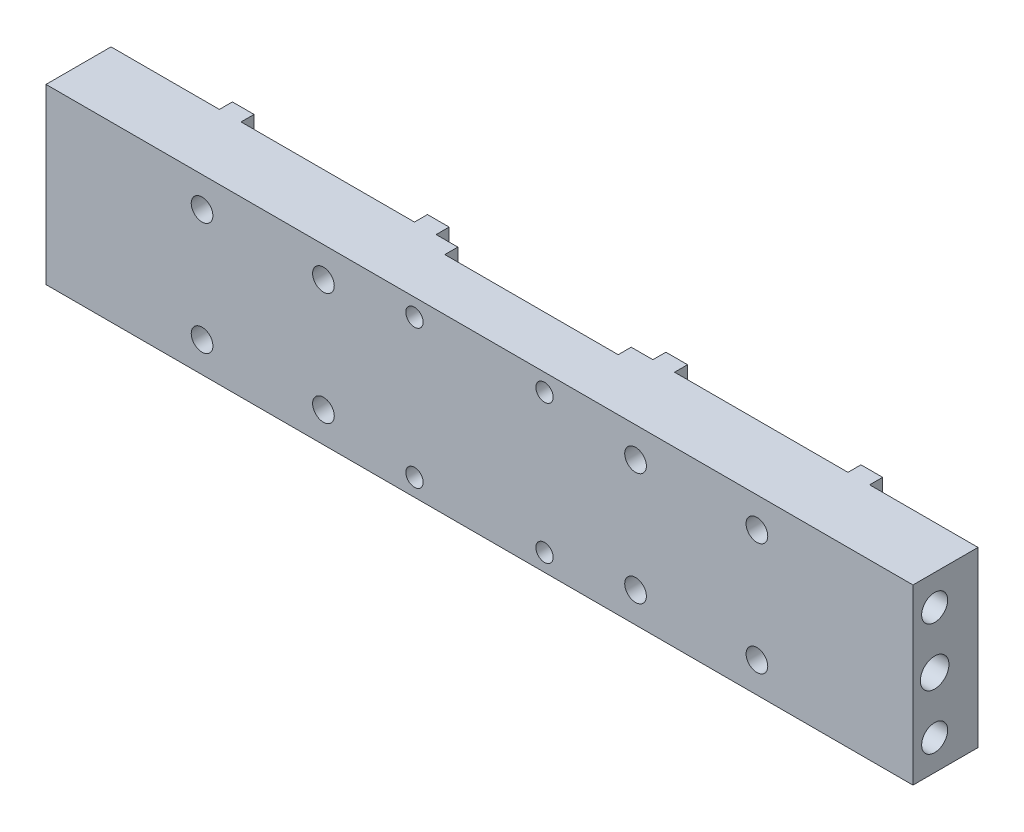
ISO-10303-21;
HEADER;
FILE_DESCRIPTION(('STEP AP214'),'2;1');
FILE_NAME('part.step','',(''),(''),'','','');
FILE_SCHEMA(('AUTOMOTIVE_DESIGN { 1 0 10303 214 1 1 1 1 }'));
ENDSEC;
DATA;
#1=APPLICATION_CONTEXT('core data for automotive mechanical design processes');
#2=APPLICATION_PROTOCOL_DEFINITION('international standard','automotive_design',2000,#1);
#3=PRODUCT_CONTEXT('',#1,'mechanical');
#4=PRODUCT('Part','Part','',(#3));
#5=PRODUCT_RELATED_PRODUCT_CATEGORY('part','',(#4));
#6=PRODUCT_DEFINITION_FORMATION('','',#4);
#7=PRODUCT_DEFINITION_CONTEXT('part definition',#1,'design');
#8=PRODUCT_DEFINITION('design','',#6,#7);
#9=PRODUCT_DEFINITION_SHAPE('','',#8);
#10=(LENGTH_UNIT() NAMED_UNIT(*) SI_UNIT(.MILLI.,.METRE.));
#11=(NAMED_UNIT(*) PLANE_ANGLE_UNIT() SI_UNIT($,.RADIAN.));
#12=(NAMED_UNIT(*) SI_UNIT($,.STERADIAN.) SOLID_ANGLE_UNIT());
#13=UNCERTAINTY_MEASURE_WITH_UNIT(LENGTH_MEASURE(1.E-05),#10,'distance_accuracy_value','');
#14=(GEOMETRIC_REPRESENTATION_CONTEXT(3) GLOBAL_UNCERTAINTY_ASSIGNED_CONTEXT((#13)) GLOBAL_UNIT_ASSIGNED_CONTEXT((#10,
#11,#12)) REPRESENTATION_CONTEXT('',''));
#15=CARTESIAN_POINT('',(0.,0.,0.));
#16=DIRECTION('',(0.,0.,1.));
#17=DIRECTION('',(1.,0.,0.));
#18=AXIS2_PLACEMENT_3D('',#15,#16,#17);
#19=CARTESIAN_POINT('',(0.,0.,-3.));
#20=DIRECTION('',(0.,0.,1.));
#21=DIRECTION('',(1.,0.,0.));
#22=AXIS2_PLACEMENT_3D('',#19,#20,#21);
#23=PLANE('',#22);
#24=CARTESIAN_POINT('',(-64.,-46.607626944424,-3.));
#25=DIRECTION('',(0.,0.,-1.));
#26=DIRECTION('',(-1.,0.,0.));
#27=AXIS2_PLACEMENT_3D('',#24,#25,#26);
#28=CIRCLE('',#27,2.5);
#29=CARTESIAN_POINT('',(-66.5,-46.607626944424,-3.));
#30=VERTEX_POINT('',#29);
#31=EDGE_CURVE('E359',#30,#30,#28,.T.);
#32=ORIENTED_EDGE('',*,*,#31,.F.);
#33=EDGE_LOOP('',(#32));
#34=FACE_BOUND('',#33,.T.);
#35=CARTESIAN_POINT('',(-64.,-20.607626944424,-3.));
#36=DIRECTION('',(0.,0.,-1.));
#37=DIRECTION('',(-1.,0.,0.));
#38=AXIS2_PLACEMENT_3D('',#35,#36,#37);
#39=CIRCLE('',#38,2.49999999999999);
#40=CARTESIAN_POINT('',(-66.5,-20.607626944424,-3.));
#41=VERTEX_POINT('',#40);
#42=EDGE_CURVE('E365',#41,#41,#39,.T.);
#43=ORIENTED_EDGE('',*,*,#42,.F.);
#44=EDGE_LOOP('',(#43));
#45=FACE_BOUND('',#44,.T.);
#46=CARTESIAN_POINT('',(-36.,-20.607626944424,-3.));
#47=DIRECTION('',(0.,0.,-1.));
#48=DIRECTION('',(-1.,0.,0.));
#49=AXIS2_PLACEMENT_3D('',#46,#47,#48);
#50=CIRCLE('',#49,2.50000000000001);
#51=CARTESIAN_POINT('',(-38.5,-20.607626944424,-3.));
#52=VERTEX_POINT('',#51);
#53=EDGE_CURVE('E362',#52,#52,#50,.T.);
#54=ORIENTED_EDGE('',*,*,#53,.F.);
#55=EDGE_LOOP('',(#54));
#56=FACE_BOUND('',#55,.T.);
#57=CARTESIAN_POINT('',(-36.,-46.607626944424,-3.));
#58=DIRECTION('',(0.,0.,-1.));
#59=DIRECTION('',(-1.,0.,0.));
#60=AXIS2_PLACEMENT_3D('',#57,#58,#59);
#61=CIRCLE('',#60,2.5);
#62=CARTESIAN_POINT('',(-38.5,-46.607626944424,-3.));
#63=VERTEX_POINT('',#62);
#64=EDGE_CURVE('E354',#63,#63,#61,.T.);
#65=ORIENTED_EDGE('',*,*,#64,.F.);
#66=EDGE_LOOP('',(#65));
#67=FACE_BOUND('',#66,.T.);
#68=DIRECTION('',(0.,-1.,0.));
#69=VECTOR('',#68,1.);
#70=CARTESIAN_POINT('',(-70.,-13.607626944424,-3.));
#71=LINE('',#70,#69);
#72=CARTESIAN_POINT('',(-70.,-13.607626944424,-3.));
#73=VERTEX_POINT('',#72);
#74=CARTESIAN_POINT('',(-70.,-53.607626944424,-3.));
#75=VERTEX_POINT('',#74);
#76=EDGE_CURVE('E227',#73,#75,#71,.T.);
#77=ORIENTED_EDGE('',*,*,#76,.F.);
#78=DIRECTION('',(1.,0.,0.));
#79=VECTOR('',#78,1.);
#80=CARTESIAN_POINT('',(-100.,-13.607626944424,-3.));
#81=LINE('',#80,#79);
#82=CARTESIAN_POINT('',(-30.,-13.607626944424,-3.));
#83=VERTEX_POINT('',#82);
#84=EDGE_CURVE('E376',#73,#83,#81,.T.);
#85=ORIENTED_EDGE('',*,*,#84,.T.);
#86=DIRECTION('',(0.,1.,0.));
#87=VECTOR('',#86,1.);
#88=CARTESIAN_POINT('',(-30.,-13.607626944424,-3.));
#89=LINE('',#88,#87);
#90=CARTESIAN_POINT('',(-30.,-53.607626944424,-3.));
#91=VERTEX_POINT('',#90);
#92=EDGE_CURVE('E278',#91,#83,#89,.T.);
#93=ORIENTED_EDGE('',*,*,#92,.F.);
#94=DIRECTION('',(-1.,0.,0.));
#95=VECTOR('',#94,1.);
#96=CARTESIAN_POINT('',(-100.,-53.607626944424,-3.));
#97=LINE('',#96,#95);
#98=EDGE_CURVE('E63',#91,#75,#97,.T.);
#99=ORIENTED_EDGE('',*,*,#98,.T.);
#100=EDGE_LOOP('',(#77,#85,#93,#99));
#101=FACE_BOUND('',#100,.T.);
#102=ADVANCED_FACE('F37',(#34,#45,#56,#67,#101),#23,.F.);
#103=DIRECTION('',(0.,1.,0.));
#104=VECTOR('',#103,1.);
#105=CARTESIAN_POINT('',(-75.,-13.607626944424,-3.));
#106=LINE('',#105,#104);
#107=CARTESIAN_POINT('',(-75.,-53.607626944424,-3.));
#108=VERTEX_POINT('',#107);
#109=CARTESIAN_POINT('',(-75.,-13.607626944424,-3.));
#110=VERTEX_POINT('',#109);
#111=EDGE_CURVE('E55',#108,#110,#106,.T.);
#112=ORIENTED_EDGE('',*,*,#111,.F.);
#113=CARTESIAN_POINT('',(-100.,-53.607626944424,-3.));
#114=VERTEX_POINT('',#113);
#115=EDGE_CURVE('E378',#108,#114,#97,.T.);
#116=ORIENTED_EDGE('',*,*,#115,.T.);
#117=DIRECTION('',(0.,1.,0.));
#118=VECTOR('',#117,1.);
#119=CARTESIAN_POINT('',(-100.,-13.607626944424,-3.));
#120=LINE('',#119,#118);
#121=CARTESIAN_POINT('',(-100.,-13.607626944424,-3.));
#122=VERTEX_POINT('',#121);
#123=EDGE_CURVE('E369',#114,#122,#120,.T.);
#124=ORIENTED_EDGE('',*,*,#123,.T.);
#125=EDGE_CURVE('E373',#122,#110,#81,.T.);
#126=ORIENTED_EDGE('',*,*,#125,.T.);
#127=EDGE_LOOP('',(#112,#116,#124,#126));
#128=FACE_BOUND('',#127,.T.);
#129=ADVANCED_FACE('F526',(#128),#23,.F.);
#130=CARTESIAN_POINT('',(0.,0.,-3.));
#131=DIRECTION('',(0.,0.,-1.));
#132=DIRECTION('',(-1.,0.,0.));
#133=AXIS2_PLACEMENT_3D('',#130,#131,#132);
#134=PLANE('',#133);
#135=CARTESIAN_POINT('',(36.,-46.607626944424,-3.));
#136=DIRECTION('',(0.,0.,-1.));
#137=DIRECTION('',(-1.,0.,0.));
#138=AXIS2_PLACEMENT_3D('',#135,#136,#137);
#139=CIRCLE('',#138,2.49999999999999);
#140=CARTESIAN_POINT('',(33.5,-46.607626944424,-3.));
#141=VERTEX_POINT('',#140);
#142=EDGE_CURVE('E390',#141,#141,#139,.T.);
#143=ORIENTED_EDGE('',*,*,#142,.F.);
#144=EDGE_LOOP('',(#143));
#145=FACE_BOUND('',#144,.T.);
#146=CARTESIAN_POINT('',(36.,-20.607626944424,-3.));
#147=DIRECTION('',(0.,0.,-1.));
#148=DIRECTION('',(-1.,0.,0.));
#149=AXIS2_PLACEMENT_3D('',#146,#147,#148);
#150=CIRCLE('',#149,2.49999999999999);
#151=CARTESIAN_POINT('',(33.5,-20.607626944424,-3.));
#152=VERTEX_POINT('',#151);
#153=EDGE_CURVE('E396',#152,#152,#150,.T.);
#154=ORIENTED_EDGE('',*,*,#153,.F.);
#155=EDGE_LOOP('',(#154));
#156=FACE_BOUND('',#155,.T.);
#157=CARTESIAN_POINT('',(64.,-20.607626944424,-3.));
#158=DIRECTION('',(0.,0.,-1.));
#159=DIRECTION('',(-1.,0.,0.));
#160=AXIS2_PLACEMENT_3D('',#157,#158,#159);
#161=CIRCLE('',#160,2.49999999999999);
#162=CARTESIAN_POINT('',(61.5,-20.607626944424,-3.));
#163=VERTEX_POINT('',#162);
#164=EDGE_CURVE('E393',#163,#163,#161,.T.);
#165=ORIENTED_EDGE('',*,*,#164,.F.);
#166=EDGE_LOOP('',(#165));
#167=FACE_BOUND('',#166,.T.);
#168=CARTESIAN_POINT('',(64.,-46.607626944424,-3.));
#169=DIRECTION('',(0.,0.,-1.));
#170=DIRECTION('',(-1.,0.,0.));
#171=AXIS2_PLACEMENT_3D('',#168,#169,#170);
#172=CIRCLE('',#171,2.50000000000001);
#173=CARTESIAN_POINT('',(61.5,-46.607626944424,-3.));
#174=VERTEX_POINT('',#173);
#175=EDGE_CURVE('E387',#174,#174,#172,.T.);
#176=ORIENTED_EDGE('',*,*,#175,.F.);
#177=EDGE_LOOP('',(#176));
#178=FACE_BOUND('',#177,.T.);
#179=DIRECTION('',(1.,0.,0.));
#180=VECTOR('',#179,1.);
#181=CARTESIAN_POINT('',(100.,-13.607626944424,-3.));
#182=LINE('',#181,#180);
#183=CARTESIAN_POINT('',(30.,-13.607626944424,-3.));
#184=VERTEX_POINT('',#183);
#185=CARTESIAN_POINT('',(70.,-13.607626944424,-3.));
#186=VERTEX_POINT('',#185);
#187=EDGE_CURVE('E413',#184,#186,#182,.T.);
#188=ORIENTED_EDGE('',*,*,#187,.T.);
#189=DIRECTION('',(0.,1.,0.));
#190=VECTOR('',#189,1.);
#191=CARTESIAN_POINT('',(70.,-13.607626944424,-3.));
#192=LINE('',#191,#190);
#193=CARTESIAN_POINT('',(70.,-53.607626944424,-3.));
#194=VERTEX_POINT('',#193);
#195=EDGE_CURVE('E251',#194,#186,#192,.T.);
#196=ORIENTED_EDGE('',*,*,#195,.F.);
#197=DIRECTION('',(-1.,0.,0.));
#198=VECTOR('',#197,1.);
#199=CARTESIAN_POINT('',(100.,-53.607626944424,-3.));
#200=LINE('',#199,#198);
#201=CARTESIAN_POINT('',(30.,-53.607626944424,-3.));
#202=VERTEX_POINT('',#201);
#203=EDGE_CURVE('E407',#194,#202,#200,.T.);
#204=ORIENTED_EDGE('',*,*,#203,.T.);
#205=DIRECTION('',(0.,-1.,0.));
#206=VECTOR('',#205,1.);
#207=CARTESIAN_POINT('',(30.,-13.607626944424,-3.));
#208=LINE('',#207,#206);
#209=EDGE_CURVE('E305',#184,#202,#208,.T.);
#210=ORIENTED_EDGE('',*,*,#209,.F.);
#211=EDGE_LOOP('',(#188,#196,#204,#210));
#212=FACE_BOUND('',#211,.T.);
#213=ADVANCED_FACE('F582',(#145,#156,#167,#178,#212),#134,.T.);
#214=CARTESIAN_POINT('',(100.,-53.607626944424,-3.));
#215=VERTEX_POINT('',#214);
#216=CARTESIAN_POINT('',(75.,-53.607626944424,-3.));
#217=VERTEX_POINT('',#216);
#218=EDGE_CURVE('E404',#215,#217,#200,.T.);
#219=ORIENTED_EDGE('',*,*,#218,.T.);
#220=DIRECTION('',(0.,-1.,0.));
#221=VECTOR('',#220,1.);
#222=CARTESIAN_POINT('',(75.,-13.607626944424,-3.));
#223=LINE('',#222,#221);
#224=CARTESIAN_POINT('',(75.,-13.607626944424,-3.));
#225=VERTEX_POINT('',#224);
#226=EDGE_CURVE('E256',#225,#217,#223,.T.);
#227=ORIENTED_EDGE('',*,*,#226,.F.);
#228=CARTESIAN_POINT('',(100.,-13.607626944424,-3.));
#229=VERTEX_POINT('',#228);
#230=EDGE_CURVE('E409',#225,#229,#182,.T.);
#231=ORIENTED_EDGE('',*,*,#230,.T.);
#232=DIRECTION('',(0.,-1.,0.));
#233=VECTOR('',#232,1.);
#234=CARTESIAN_POINT('',(100.,-13.607626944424,-3.));
#235=LINE('',#234,#233);
#236=EDGE_CURVE('E400',#229,#215,#235,.T.);
#237=ORIENTED_EDGE('',*,*,#236,.T.);
#238=EDGE_LOOP('',(#219,#227,#231,#237));
#239=FACE_BOUND('',#238,.T.);
#240=ADVANCED_FACE('F511',(#239),#134,.T.);
#241=DIRECTION('',(0.,-1.,0.));
#242=VECTOR('',#241,1.);
#243=CARTESIAN_POINT('',(-25.,-13.607626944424,-3.));
#244=LINE('',#243,#242);
#245=CARTESIAN_POINT('',(-25.,-13.607626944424,-3.));
#246=VERTEX_POINT('',#245);
#247=CARTESIAN_POINT('',(-25.,-53.607626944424,-3.));
#248=VERTEX_POINT('',#247);
#249=EDGE_CURVE('E283',#246,#248,#244,.T.);
#250=ORIENTED_EDGE('',*,*,#249,.F.);
#251=CARTESIAN_POINT('',(-20.,-13.607626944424,-3.));
#252=VERTEX_POINT('',#251);
#253=EDGE_CURVE('E372',#246,#252,#81,.T.);
#254=ORIENTED_EDGE('',*,*,#253,.T.);
#255=DIRECTION('',(0.,-1.,0.));
#256=VECTOR('',#255,1.);
#257=CARTESIAN_POINT('',(-20.,-13.607626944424,-3.));
#258=LINE('',#257,#256);
#259=CARTESIAN_POINT('',(-20.,-53.607626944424,-3.));
#260=VERTEX_POINT('',#259);
#261=EDGE_CURVE('E375',#252,#260,#258,.T.);
#262=ORIENTED_EDGE('',*,*,#261,.T.);
#263=EDGE_CURVE('E379',#260,#248,#97,.T.);
#264=ORIENTED_EDGE('',*,*,#263,.T.);
#265=EDGE_LOOP('',(#250,#254,#262,#264));
#266=FACE_BOUND('',#265,.T.);
#267=ADVANCED_FACE('F555',(#266),#23,.F.);
#268=CARTESIAN_POINT('',(20.,-13.607626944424,-3.));
#269=VERTEX_POINT('',#268);
#270=CARTESIAN_POINT('',(25.,-13.607626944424,-3.));
#271=VERTEX_POINT('',#270);
#272=EDGE_CURVE('E410',#269,#271,#182,.T.);
#273=ORIENTED_EDGE('',*,*,#272,.T.);
#274=DIRECTION('',(0.,1.,0.));
#275=VECTOR('',#274,1.);
#276=CARTESIAN_POINT('',(25.,-13.607626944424,-3.));
#277=LINE('',#276,#275);
#278=CARTESIAN_POINT('',(25.,-53.607626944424,-3.));
#279=VERTEX_POINT('',#278);
#280=EDGE_CURVE('E310',#279,#271,#277,.T.);
#281=ORIENTED_EDGE('',*,*,#280,.F.);
#282=CARTESIAN_POINT('',(20.,-53.607626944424,-3.));
#283=VERTEX_POINT('',#282);
#284=EDGE_CURVE('E403',#279,#283,#200,.T.);
#285=ORIENTED_EDGE('',*,*,#284,.T.);
#286=DIRECTION('',(0.,1.,0.));
#287=VECTOR('',#286,1.);
#288=CARTESIAN_POINT('',(20.,-13.607626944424,-3.));
#289=LINE('',#288,#287);
#290=EDGE_CURVE('E406',#283,#269,#289,.T.);
#291=ORIENTED_EDGE('',*,*,#290,.T.);
#292=EDGE_LOOP('',(#273,#281,#285,#291));
#293=FACE_BOUND('',#292,.T.);
#294=ADVANCED_FACE('F573',(#293),#134,.T.);
#295=CARTESIAN_POINT('',(-100.,-53.607626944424,0.));
#296=DIRECTION('',(0.,0.,1.));
#297=DIRECTION('',(1.,0.,0.));
#298=AXIS2_PLACEMENT_3D('',#295,#296,#297);
#299=PLANE('',#298);
#300=CARTESIAN_POINT('',(-15.,-17.607626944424,0.));
#301=DIRECTION('',(0.,0.,1.));
#302=DIRECTION('',(1.,0.,0.));
#303=AXIS2_PLACEMENT_3D('',#300,#301,#302);
#304=CIRCLE('',#303,2.);
#305=CARTESIAN_POINT('',(-13.,-17.607626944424,0.));
#306=VERTEX_POINT('',#305);
#307=EDGE_CURVE('E439',#306,#306,#304,.T.);
#308=ORIENTED_EDGE('',*,*,#307,.T.);
#309=EDGE_LOOP('',(#308));
#310=FACE_BOUND('',#309,.T.);
#311=CARTESIAN_POINT('',(15.,-17.607626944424,0.));
#312=DIRECTION('',(0.,0.,1.));
#313=DIRECTION('',(1.,0.,0.));
#314=AXIS2_PLACEMENT_3D('',#311,#312,#313);
#315=CIRCLE('',#314,2.);
#316=CARTESIAN_POINT('',(17.,-17.607626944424,0.));
#317=VERTEX_POINT('',#316);
#318=EDGE_CURVE('E450',#317,#317,#315,.T.);
#319=ORIENTED_EDGE('',*,*,#318,.T.);
#320=EDGE_LOOP('',(#319));
#321=FACE_BOUND('',#320,.T.);
#322=CARTESIAN_POINT('',(15.,-49.607626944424,0.));
#323=DIRECTION('',(0.,0.,1.));
#324=DIRECTION('',(1.,0.,0.));
#325=AXIS2_PLACEMENT_3D('',#322,#323,#324);
#326=CIRCLE('',#325,2.);
#327=CARTESIAN_POINT('',(17.,-49.607626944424,0.));
#328=VERTEX_POINT('',#327);
#329=EDGE_CURVE('E444',#328,#328,#326,.T.);
#330=ORIENTED_EDGE('',*,*,#329,.T.);
#331=EDGE_LOOP('',(#330));
#332=FACE_BOUND('',#331,.T.);
#333=CARTESIAN_POINT('',(-15.,-49.607626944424,0.));
#334=DIRECTION('',(0.,0.,1.));
#335=DIRECTION('',(1.,0.,0.));
#336=AXIS2_PLACEMENT_3D('',#333,#334,#335);
#337=CIRCLE('',#336,2.);
#338=CARTESIAN_POINT('',(-13.,-49.607626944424,0.));
#339=VERTEX_POINT('',#338);
#340=EDGE_CURVE('E430',#339,#339,#337,.T.);
#341=ORIENTED_EDGE('',*,*,#340,.T.);
#342=EDGE_LOOP('',(#341));
#343=FACE_BOUND('',#342,.T.);
#344=DIRECTION('',(0.,-1.,0.));
#345=VECTOR('',#344,1.);
#346=CARTESIAN_POINT('',(-20.,-13.607626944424,0.));
#347=LINE('',#346,#345);
#348=CARTESIAN_POINT('',(-20.,-13.607626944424,0.));
#349=VERTEX_POINT('',#348);
#350=CARTESIAN_POINT('',(-20.,-53.607626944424,0.));
#351=VERTEX_POINT('',#350);
#352=EDGE_CURVE('E368',#349,#351,#347,.T.);
#353=ORIENTED_EDGE('',*,*,#352,.F.);
#354=DIRECTION('',(-1.,0.,0.));
#355=VECTOR('',#354,1.);
#356=CARTESIAN_POINT('',(-100.,-13.607626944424,0.));
#357=LINE('',#356,#355);
#358=CARTESIAN_POINT('',(20.,-13.607626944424,0.));
#359=VERTEX_POINT('',#358);
#360=EDGE_CURVE('E422',#359,#349,#357,.T.);
#361=ORIENTED_EDGE('',*,*,#360,.F.);
#362=DIRECTION('',(0.,1.,0.));
#363=VECTOR('',#362,1.);
#364=CARTESIAN_POINT('',(20.,-13.607626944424,0.));
#365=LINE('',#364,#363);
#366=CARTESIAN_POINT('',(20.,-53.607626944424,0.));
#367=VERTEX_POINT('',#366);
#368=EDGE_CURVE('E399',#367,#359,#365,.T.);
#369=ORIENTED_EDGE('',*,*,#368,.F.);
#370=DIRECTION('',(1.,0.,0.));
#371=VECTOR('',#370,1.);
#372=CARTESIAN_POINT('',(-100.,-53.607626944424,0.));
#373=LINE('',#372,#371);
#374=EDGE_CURVE('E41',#351,#367,#373,.T.);
#375=ORIENTED_EDGE('',*,*,#374,.F.);
#376=EDGE_LOOP('',(#353,#361,#369,#375));
#377=FACE_BOUND('',#376,.T.);
#378=ADVANCED_FACE('F566',(#310,#321,#332,#343,#377),#299,.F.);
#379=CARTESIAN_POINT('',(-100.,-53.607626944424,12.));
#380=DIRECTION('',(0.,0.,1.));
#381=DIRECTION('',(1.,0.,0.));
#382=AXIS2_PLACEMENT_3D('',#379,#380,#381);
#383=PLANE('',#382);
#384=CARTESIAN_POINT('',(-15.,-17.607626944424,12.));
#385=DIRECTION('',(0.,0.,1.));
#386=DIRECTION('',(1.,0.,0.));
#387=AXIS2_PLACEMENT_3D('',#384,#385,#386);
#388=CIRCLE('',#387,2.);
#389=CARTESIAN_POINT('',(-13.,-17.607626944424,12.));
#390=VERTEX_POINT('',#389);
#391=EDGE_CURVE('E441',#390,#390,#388,.T.);
#392=ORIENTED_EDGE('',*,*,#391,.F.);
#393=EDGE_LOOP('',(#392));
#394=FACE_BOUND('',#393,.T.);
#395=CARTESIAN_POINT('',(15.,-17.607626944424,12.));
#396=DIRECTION('',(0.,0.,1.));
#397=DIRECTION('',(1.,0.,0.));
#398=AXIS2_PLACEMENT_3D('',#395,#396,#397);
#399=CIRCLE('',#398,2.);
#400=CARTESIAN_POINT('',(17.,-17.607626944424,12.));
#401=VERTEX_POINT('',#400);
#402=EDGE_CURVE('E453',#401,#401,#399,.T.);
#403=ORIENTED_EDGE('',*,*,#402,.F.);
#404=EDGE_LOOP('',(#403));
#405=FACE_BOUND('',#404,.T.);
#406=CARTESIAN_POINT('',(36.,-46.607626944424,12.));
#407=DIRECTION('',(0.,0.,1.));
#408=DIRECTION('',(1.,0.,0.));
#409=AXIS2_PLACEMENT_3D('',#406,#407,#408);
#410=CIRCLE('',#409,2.5);
#411=CARTESIAN_POINT('',(38.5,-46.607626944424,12.));
#412=VERTEX_POINT('',#411);
#413=EDGE_CURVE('E461',#412,#412,#410,.T.);
#414=ORIENTED_EDGE('',*,*,#413,.F.);
#415=EDGE_LOOP('',(#414));
#416=FACE_BOUND('',#415,.T.);
#417=CARTESIAN_POINT('',(36.,-20.607626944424,12.));
#418=DIRECTION('',(0.,0.,1.));
#419=DIRECTION('',(1.,0.,0.));
#420=AXIS2_PLACEMENT_3D('',#417,#418,#419);
#421=CIRCLE('',#420,2.49999999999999);
#422=CARTESIAN_POINT('',(38.5,-20.607626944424,12.));
#423=VERTEX_POINT('',#422);
#424=EDGE_CURVE('E467',#423,#423,#421,.T.);
#425=ORIENTED_EDGE('',*,*,#424,.F.);
#426=EDGE_LOOP('',(#425));
#427=FACE_BOUND('',#426,.T.);
#428=CARTESIAN_POINT('',(-64.,-46.607626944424,12.));
#429=DIRECTION('',(0.,0.,1.));
#430=DIRECTION('',(1.,0.,0.));
#431=AXIS2_PLACEMENT_3D('',#428,#429,#430);
#432=CIRCLE('',#431,2.5);
#433=CARTESIAN_POINT('',(-61.5,-46.607626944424,12.));
#434=VERTEX_POINT('',#433);
#435=EDGE_CURVE('E473',#434,#434,#432,.T.);
#436=ORIENTED_EDGE('',*,*,#435,.F.);
#437=EDGE_LOOP('',(#436));
#438=FACE_BOUND('',#437,.T.);
#439=CARTESIAN_POINT('',(-64.,-20.607626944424,12.));
#440=DIRECTION('',(0.,0.,1.));
#441=DIRECTION('',(1.,0.,0.));
#442=AXIS2_PLACEMENT_3D('',#439,#440,#441);
#443=CIRCLE('',#442,2.49999999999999);
#444=CARTESIAN_POINT('',(-61.5,-20.607626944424,12.));
#445=VERTEX_POINT('',#444);
#446=EDGE_CURVE('E479',#445,#445,#443,.T.);
#447=ORIENTED_EDGE('',*,*,#446,.F.);
#448=EDGE_LOOP('',(#447));
#449=FACE_BOUND('',#448,.T.);
#450=DIRECTION('',(0.,-1.,0.));
#451=VECTOR('',#450,1.);
#452=CARTESIAN_POINT('',(-100.,-13.607626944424,12.));
#453=LINE('',#452,#451);
#454=CARTESIAN_POINT('',(-100.,-13.607626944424,12.));
#455=VERTEX_POINT('',#454);
#456=CARTESIAN_POINT('',(-100.,-53.607626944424,12.));
#457=VERTEX_POINT('',#456);
#458=EDGE_CURVE('E482',#455,#457,#453,.T.);
#459=ORIENTED_EDGE('',*,*,#458,.T.);
#460=DIRECTION('',(1.,0.,0.));
#461=VECTOR('',#460,1.);
#462=CARTESIAN_POINT('',(-100.,-53.607626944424,12.));
#463=LINE('',#462,#461);
#464=CARTESIAN_POINT('',(100.,-53.607626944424,12.));
#465=VERTEX_POINT('',#464);
#466=EDGE_CURVE('E485',#457,#465,#463,.T.);
#467=ORIENTED_EDGE('',*,*,#466,.T.);
#468=DIRECTION('',(0.,1.,0.));
#469=VECTOR('',#468,1.);
#470=CARTESIAN_POINT('',(100.,-13.607626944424,12.));
#471=LINE('',#470,#469);
#472=CARTESIAN_POINT('',(100.,-13.607626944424,12.));
#473=VERTEX_POINT('',#472);
#474=EDGE_CURVE('E487',#465,#473,#471,.T.);
#475=ORIENTED_EDGE('',*,*,#474,.T.);
#476=DIRECTION('',(-1.,0.,0.));
#477=VECTOR('',#476,1.);
#478=CARTESIAN_POINT('',(-100.,-13.607626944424,12.));
#479=LINE('',#478,#477);
#480=EDGE_CURVE('E489',#473,#455,#479,.T.);
#481=ORIENTED_EDGE('',*,*,#480,.T.);
#482=EDGE_LOOP('',(#459,#467,#475,#481));
#483=FACE_BOUND('',#482,.T.);
#484=CARTESIAN_POINT('',(-36.,-20.607626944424,12.));
#485=DIRECTION('',(0.,0.,1.));
#486=DIRECTION('',(1.,0.,0.));
#487=AXIS2_PLACEMENT_3D('',#484,#485,#486);
#488=CIRCLE('',#487,2.50000000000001);
#489=CARTESIAN_POINT('',(-33.5,-20.607626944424,12.));
#490=VERTEX_POINT('',#489);
#491=EDGE_CURVE('E476',#490,#490,#488,.T.);
#492=ORIENTED_EDGE('',*,*,#491,.F.);
#493=EDGE_LOOP('',(#492));
#494=FACE_BOUND('',#493,.T.);
#495=CARTESIAN_POINT('',(-36.,-46.607626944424,12.));
#496=DIRECTION('',(0.,0.,1.));
#497=DIRECTION('',(1.,0.,0.));
#498=AXIS2_PLACEMENT_3D('',#495,#496,#497);
#499=CIRCLE('',#498,2.5);
#500=CARTESIAN_POINT('',(-33.5,-46.607626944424,12.));
#501=VERTEX_POINT('',#500);
#502=EDGE_CURVE('E470',#501,#501,#499,.T.);
#503=ORIENTED_EDGE('',*,*,#502,.F.);
#504=EDGE_LOOP('',(#503));
#505=FACE_BOUND('',#504,.T.);
#506=CARTESIAN_POINT('',(64.,-20.607626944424,12.));
#507=DIRECTION('',(0.,0.,1.));
#508=DIRECTION('',(1.,0.,0.));
#509=AXIS2_PLACEMENT_3D('',#506,#507,#508);
#510=CIRCLE('',#509,2.5);
#511=CARTESIAN_POINT('',(66.5,-20.607626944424,12.));
#512=VERTEX_POINT('',#511);
#513=EDGE_CURVE('E464',#512,#512,#510,.T.);
#514=ORIENTED_EDGE('',*,*,#513,.F.);
#515=EDGE_LOOP('',(#514));
#516=FACE_BOUND('',#515,.T.);
#517=CARTESIAN_POINT('',(64.,-46.607626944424,12.));
#518=DIRECTION('',(0.,0.,1.));
#519=DIRECTION('',(1.,0.,0.));
#520=AXIS2_PLACEMENT_3D('',#517,#518,#519);
#521=CIRCLE('',#520,2.5);
#522=CARTESIAN_POINT('',(66.5,-46.607626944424,12.));
#523=VERTEX_POINT('',#522);
#524=EDGE_CURVE('E456',#523,#523,#521,.T.);
#525=ORIENTED_EDGE('',*,*,#524,.F.);
#526=EDGE_LOOP('',(#525));
#527=FACE_BOUND('',#526,.T.);
#528=CARTESIAN_POINT('',(15.,-49.607626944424,12.));
#529=DIRECTION('',(0.,0.,1.));
#530=DIRECTION('',(1.,0.,0.));
#531=AXIS2_PLACEMENT_3D('',#528,#529,#530);
#532=CIRCLE('',#531,2.);
#533=CARTESIAN_POINT('',(17.,-49.607626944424,12.));
#534=VERTEX_POINT('',#533);
#535=EDGE_CURVE('E447',#534,#534,#532,.T.);
#536=ORIENTED_EDGE('',*,*,#535,.F.);
#537=EDGE_LOOP('',(#536));
#538=FACE_BOUND('',#537,.T.);
#539=CARTESIAN_POINT('',(-15.,-49.607626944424,12.));
#540=DIRECTION('',(0.,0.,1.));
#541=DIRECTION('',(1.,0.,0.));
#542=AXIS2_PLACEMENT_3D('',#539,#540,#541);
#543=CIRCLE('',#542,2.);
#544=CARTESIAN_POINT('',(-13.,-49.607626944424,12.));
#545=VERTEX_POINT('',#544);
#546=EDGE_CURVE('E416',#545,#545,#543,.T.);
#547=ORIENTED_EDGE('',*,*,#546,.F.);
#548=EDGE_LOOP('',(#547));
#549=FACE_BOUND('',#548,.T.);
#550=ADVANCED_FACE('F520',(#394,#405,#416,#427,#438,#449,#483,#494,#505,#516,#527,#538,#549),
#383,.T.);
#551=CARTESIAN_POINT('',(-100.,-13.607626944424,12.));
#552=DIRECTION('',(1.,0.,0.));
#553=DIRECTION('',(0.,1.,0.));
#554=AXIS2_PLACEMENT_3D('',#551,#552,#553);
#555=PLANE('',#554);
#556=CARTESIAN_POINT('',(-100.,-33.607626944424,7.));
#557=DIRECTION('',(-1.,0.,0.));
#558=DIRECTION('',(0.,0.,1.));
#559=AXIS2_PLACEMENT_3D('',#556,#557,#558);
#560=CIRCLE('',#559,3.29999999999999);
#561=CARTESIAN_POINT('',(-100.,-33.607626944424,10.3));
#562=VERTEX_POINT('',#561);
#563=EDGE_CURVE('E216',#562,#562,#560,.T.);
#564=ORIENTED_EDGE('',*,*,#563,.F.);
#565=EDGE_LOOP('',(#564));
#566=FACE_BOUND('',#565,.T.);
#567=CARTESIAN_POINT('',(-100.,-46.607626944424,7.));
#568=DIRECTION('',(-1.,0.,0.));
#569=DIRECTION('',(0.,-1.,0.));
#570=AXIS2_PLACEMENT_3D('',#567,#568,#569);
#571=CIRCLE('',#570,3.);
#572=CARTESIAN_POINT('',(-100.,-49.607626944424,7.));
#573=VERTEX_POINT('',#572);
#574=EDGE_CURVE('E342',#573,#573,#571,.T.);
#575=ORIENTED_EDGE('',*,*,#574,.F.);
#576=EDGE_LOOP('',(#575));
#577=FACE_BOUND('',#576,.T.);
#578=CARTESIAN_POINT('',(-100.,-20.607626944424,7.));
#579=DIRECTION('',(-1.,0.,0.));
#580=DIRECTION('',(0.,-1.,0.));
#581=AXIS2_PLACEMENT_3D('',#578,#579,#580);
#582=CIRCLE('',#581,3.);
#583=CARTESIAN_POINT('',(-100.,-23.607626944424,7.));
#584=VERTEX_POINT('',#583);
#585=EDGE_CURVE('E348',#584,#584,#582,.T.);
#586=ORIENTED_EDGE('',*,*,#585,.F.);
#587=EDGE_LOOP('',(#586));
#588=FACE_BOUND('',#587,.T.);
#589=DIRECTION('',(0.,0.,-1.));
#590=VECTOR('',#589,1.);
#591=CARTESIAN_POINT('',(-100.,-13.607626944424,12.));
#592=LINE('',#591,#590);
#593=EDGE_CURVE('E490',#455,#122,#592,.T.);
#594=ORIENTED_EDGE('',*,*,#593,.T.);
#595=ORIENTED_EDGE('',*,*,#123,.F.);
#596=DIRECTION('',(0.,0.,-1.));
#597=VECTOR('',#596,1.);
#598=CARTESIAN_POINT('',(-100.,-53.607626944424,12.));
#599=LINE('',#598,#597);
#600=EDGE_CURVE('E11',#457,#114,#599,.T.);
#601=ORIENTED_EDGE('',*,*,#600,.F.);
#602=ORIENTED_EDGE('',*,*,#458,.F.);
#603=EDGE_LOOP('',(#594,#595,#601,#602));
#604=FACE_BOUND('',#603,.T.);
#605=ADVANCED_FACE('F39',(#566,#577,#588,#604),#555,.F.);
#606=CARTESIAN_POINT('',(-100.,-53.607626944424,12.));
#607=DIRECTION('',(0.,1.,0.));
#608=DIRECTION('',(0.,0.,1.));
#609=AXIS2_PLACEMENT_3D('',#606,#607,#608);
#610=PLANE('',#609);
#611=ORIENTED_EDGE('',*,*,#600,.T.);
#612=ORIENTED_EDGE('',*,*,#115,.F.);
#613=DIRECTION('',(0.,0.,1.));
#614=VECTOR('',#613,1.);
#615=CARTESIAN_POINT('',(-75.,-53.607626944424,-6.));
#616=LINE('',#615,#614);
#617=CARTESIAN_POINT('',(-75.,-53.607626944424,-6.));
#618=VERTEX_POINT('',#617);
#619=EDGE_CURVE('E246',#618,#108,#616,.T.);
#620=ORIENTED_EDGE('',*,*,#619,.F.);
#621=DIRECTION('',(-1.,0.,0.));
#622=VECTOR('',#621,1.);
#623=CARTESIAN_POINT('',(-70.,-53.607626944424,-6.));
#624=LINE('',#623,#622);
#625=CARTESIAN_POINT('',(-70.,-53.607626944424,-6.));
#626=VERTEX_POINT('',#625);
#627=EDGE_CURVE('E231',#626,#618,#624,.T.);
#628=ORIENTED_EDGE('',*,*,#627,.F.);
#629=DIRECTION('',(0.,0.,1.));
#630=VECTOR('',#629,1.);
#631=CARTESIAN_POINT('',(-70.,-53.607626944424,-6.));
#632=LINE('',#631,#630);
#633=EDGE_CURVE('E249',#626,#75,#632,.T.);
#634=ORIENTED_EDGE('',*,*,#633,.T.);
#635=ORIENTED_EDGE('',*,*,#98,.F.);
#636=DIRECTION('',(0.,0.,1.));
#637=VECTOR('',#636,1.);
#638=CARTESIAN_POINT('',(-30.,-53.607626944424,-6.));
#639=LINE('',#638,#637);
#640=CARTESIAN_POINT('',(-30.,-53.607626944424,-6.));
#641=VERTEX_POINT('',#640);
#642=EDGE_CURVE('E289',#641,#91,#639,.T.);
#643=ORIENTED_EDGE('',*,*,#642,.F.);
#644=DIRECTION('',(-1.,0.,0.));
#645=VECTOR('',#644,1.);
#646=CARTESIAN_POINT('',(-25.,-53.607626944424,-6.));
#647=LINE('',#646,#645);
#648=CARTESIAN_POINT('',(-25.,-53.607626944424,-6.));
#649=VERTEX_POINT('',#648);
#650=EDGE_CURVE('E287',#649,#641,#647,.T.);
#651=ORIENTED_EDGE('',*,*,#650,.F.);
#652=DIRECTION('',(0.,0.,1.));
#653=VECTOR('',#652,1.);
#654=CARTESIAN_POINT('',(-25.,-53.607626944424,-6.));
#655=LINE('',#654,#653);
#656=EDGE_CURVE('E296',#649,#248,#655,.T.);
#657=ORIENTED_EDGE('',*,*,#656,.T.);
#658=ORIENTED_EDGE('',*,*,#263,.F.);
#659=DIRECTION('',(0.,0.,1.));
#660=VECTOR('',#659,1.);
#661=CARTESIAN_POINT('',(-20.,-53.607626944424,-3.));
#662=LINE('',#661,#660);
#663=EDGE_CURVE('E381',#260,#351,#662,.T.);
#664=ORIENTED_EDGE('',*,*,#663,.T.);
#665=ORIENTED_EDGE('',*,*,#374,.T.);
#666=DIRECTION('',(0.,0.,1.));
#667=VECTOR('',#666,1.);
#668=CARTESIAN_POINT('',(20.,-53.607626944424,-3.));
#669=LINE('',#668,#667);
#670=EDGE_CURVE('E426',#283,#367,#669,.T.);
#671=ORIENTED_EDGE('',*,*,#670,.F.);
#672=ORIENTED_EDGE('',*,*,#284,.F.);
#673=DIRECTION('',(0.,0.,1.));
#674=VECTOR('',#673,1.);
#675=CARTESIAN_POINT('',(25.,-53.607626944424,-6.));
#676=LINE('',#675,#674);
#677=CARTESIAN_POINT('',(25.,-53.607626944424,-6.));
#678=VERTEX_POINT('',#677);
#679=EDGE_CURVE('E326',#678,#279,#676,.T.);
#680=ORIENTED_EDGE('',*,*,#679,.F.);
#681=DIRECTION('',(-1.,0.,0.));
#682=VECTOR('',#681,1.);
#683=CARTESIAN_POINT('',(30.,-53.607626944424,-6.));
#684=LINE('',#683,#682);
#685=CARTESIAN_POINT('',(30.,-53.607626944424,-6.));
#686=VERTEX_POINT('',#685);
#687=EDGE_CURVE('E309',#686,#678,#684,.T.);
#688=ORIENTED_EDGE('',*,*,#687,.F.);
#689=DIRECTION('',(0.,0.,1.));
#690=VECTOR('',#689,1.);
#691=CARTESIAN_POINT('',(30.,-53.607626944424,-6.));
#692=LINE('',#691,#690);
#693=EDGE_CURVE('E329',#686,#202,#692,.T.);
#694=ORIENTED_EDGE('',*,*,#693,.T.);
#695=ORIENTED_EDGE('',*,*,#203,.F.);
#696=DIRECTION('',(0.,0.,1.));
#697=VECTOR('',#696,1.);
#698=CARTESIAN_POINT('',(70.,-53.607626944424,-6.));
#699=LINE('',#698,#697);
#700=CARTESIAN_POINT('',(70.,-53.607626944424,-6.));
#701=VERTEX_POINT('',#700);
#702=EDGE_CURVE('E262',#701,#194,#699,.T.);
#703=ORIENTED_EDGE('',*,*,#702,.F.);
#704=DIRECTION('',(-1.,0.,0.));
#705=VECTOR('',#704,1.);
#706=CARTESIAN_POINT('',(75.,-53.607626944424,-6.));
#707=LINE('',#706,#705);
#708=CARTESIAN_POINT('',(75.,-53.607626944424,-6.));
#709=VERTEX_POINT('',#708);
#710=EDGE_CURVE('E260',#709,#701,#707,.T.);
#711=ORIENTED_EDGE('',*,*,#710,.F.);
#712=DIRECTION('',(0.,0.,1.));
#713=VECTOR('',#712,1.);
#714=CARTESIAN_POINT('',(75.,-53.607626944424,-6.));
#715=LINE('',#714,#713);
#716=EDGE_CURVE('E269',#709,#217,#715,.T.);
#717=ORIENTED_EDGE('',*,*,#716,.T.);
#718=ORIENTED_EDGE('',*,*,#218,.F.);
#719=DIRECTION('',(0.,0.,-1.));
#720=VECTOR('',#719,1.);
#721=CARTESIAN_POINT('',(100.,-53.607626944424,12.));
#722=LINE('',#721,#720);
#723=EDGE_CURVE('E47',#465,#215,#722,.T.);
#724=ORIENTED_EDGE('',*,*,#723,.F.);
#725=ORIENTED_EDGE('',*,*,#466,.F.);
#726=EDGE_LOOP('',(#611,#612,#620,#628,#634,#635,#643,#651,#657,#658,#664,#665,#671,#672,#680,
#688,#694,#695,#703,#711,#717,#718,#724,#725));
#727=FACE_BOUND('',#726,.T.);
#728=ADVANCED_FACE('F506',(#727),#610,.F.);
#729=CARTESIAN_POINT('',(100.,-13.607626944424,12.));
#730=DIRECTION('',(-1.,0.,0.));
#731=DIRECTION('',(0.,0.,1.));
#732=AXIS2_PLACEMENT_3D('',#729,#730,#731);
#733=PLANE('',#732);
#734=CARTESIAN_POINT('',(100.,-33.607626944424,7.));
#735=DIRECTION('',(1.,0.,0.));
#736=DIRECTION('',(0.,0.,-1.));
#737=AXIS2_PLACEMENT_3D('',#734,#735,#736);
#738=CIRCLE('',#737,3.29999999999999);
#739=CARTESIAN_POINT('',(100.,-33.607626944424,3.70000000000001));
#740=VERTEX_POINT('',#739);
#741=EDGE_CURVE('E217',#740,#740,#738,.T.);
#742=ORIENTED_EDGE('',*,*,#741,.F.);
#743=EDGE_LOOP('',(#742));
#744=FACE_BOUND('',#743,.T.);
#745=CARTESIAN_POINT('',(100.,-46.607626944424,7.));
#746=DIRECTION('',(1.,0.,0.));
#747=DIRECTION('',(0.,0.,-1.));
#748=AXIS2_PLACEMENT_3D('',#745,#746,#747);
#749=CIRCLE('',#748,3.);
#750=CARTESIAN_POINT('',(100.,-46.607626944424,4.));
#751=VERTEX_POINT('',#750);
#752=EDGE_CURVE('E332',#751,#751,#749,.T.);
#753=ORIENTED_EDGE('',*,*,#752,.F.);
#754=EDGE_LOOP('',(#753));
#755=FACE_BOUND('',#754,.T.);
#756=CARTESIAN_POINT('',(100.,-20.607626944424,7.));
#757=DIRECTION('',(1.,0.,0.));
#758=DIRECTION('',(0.,0.,-1.));
#759=AXIS2_PLACEMENT_3D('',#756,#757,#758);
#760=CIRCLE('',#759,3.);
#761=CARTESIAN_POINT('',(100.,-20.607626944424,4.));
#762=VERTEX_POINT('',#761);
#763=EDGE_CURVE('E336',#762,#762,#760,.T.);
#764=ORIENTED_EDGE('',*,*,#763,.F.);
#765=EDGE_LOOP('',(#764));
#766=FACE_BOUND('',#765,.T.);
#767=ORIENTED_EDGE('',*,*,#723,.T.);
#768=ORIENTED_EDGE('',*,*,#236,.F.);
#769=DIRECTION('',(0.,0.,-1.));
#770=VECTOR('',#769,1.);
#771=CARTESIAN_POINT('',(100.,-13.607626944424,12.));
#772=LINE('',#771,#770);
#773=EDGE_CURVE('E495',#473,#229,#772,.T.);
#774=ORIENTED_EDGE('',*,*,#773,.F.);
#775=ORIENTED_EDGE('',*,*,#474,.F.);
#776=EDGE_LOOP('',(#767,#768,#774,#775));
#777=FACE_BOUND('',#776,.T.);
#778=ADVANCED_FACE('F503',(#744,#755,#766,#777),#733,.F.);
#779=CARTESIAN_POINT('',(-100.,-13.607626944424,12.));
#780=DIRECTION('',(0.,-1.,0.));
#781=DIRECTION('',(1.,0.,0.));
#782=AXIS2_PLACEMENT_3D('',#779,#780,#781);
#783=PLANE('',#782);
#784=ORIENTED_EDGE('',*,*,#773,.T.);
#785=ORIENTED_EDGE('',*,*,#230,.F.);
#786=DIRECTION('',(0.,0.,1.));
#787=VECTOR('',#786,1.);
#788=CARTESIAN_POINT('',(75.,-13.607626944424,-6.));
#789=LINE('',#788,#787);
#790=CARTESIAN_POINT('',(75.,-13.607626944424,-6.));
#791=VERTEX_POINT('',#790);
#792=EDGE_CURVE('E272',#791,#225,#789,.T.);
#793=ORIENTED_EDGE('',*,*,#792,.F.);
#794=DIRECTION('',(1.,0.,0.));
#795=VECTOR('',#794,1.);
#796=CARTESIAN_POINT('',(75.,-13.607626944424,-6.));
#797=LINE('',#796,#795);
#798=CARTESIAN_POINT('',(70.,-13.607626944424,-6.));
#799=VERTEX_POINT('',#798);
#800=EDGE_CURVE('E255',#799,#791,#797,.T.);
#801=ORIENTED_EDGE('',*,*,#800,.F.);
#802=DIRECTION('',(0.,0.,1.));
#803=VECTOR('',#802,1.);
#804=CARTESIAN_POINT('',(70.,-13.607626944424,-6.));
#805=LINE('',#804,#803);
#806=EDGE_CURVE('E275',#799,#186,#805,.T.);
#807=ORIENTED_EDGE('',*,*,#806,.T.);
#808=ORIENTED_EDGE('',*,*,#187,.F.);
#809=DIRECTION('',(0.,0.,1.));
#810=VECTOR('',#809,1.);
#811=CARTESIAN_POINT('',(30.,-13.607626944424,-6.));
#812=LINE('',#811,#810);
#813=CARTESIAN_POINT('',(30.,-13.607626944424,-6.));
#814=VERTEX_POINT('',#813);
#815=EDGE_CURVE('E316',#814,#184,#812,.T.);
#816=ORIENTED_EDGE('',*,*,#815,.F.);
#817=DIRECTION('',(1.,0.,0.));
#818=VECTOR('',#817,1.);
#819=CARTESIAN_POINT('',(30.,-13.607626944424,-6.));
#820=LINE('',#819,#818);
#821=CARTESIAN_POINT('',(25.,-13.607626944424,-6.));
#822=VERTEX_POINT('',#821);
#823=EDGE_CURVE('E314',#822,#814,#820,.T.);
#824=ORIENTED_EDGE('',*,*,#823,.F.);
#825=DIRECTION('',(0.,0.,1.));
#826=VECTOR('',#825,1.);
#827=CARTESIAN_POINT('',(25.,-13.607626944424,-6.));
#828=LINE('',#827,#826);
#829=EDGE_CURVE('E323',#822,#271,#828,.T.);
#830=ORIENTED_EDGE('',*,*,#829,.T.);
#831=ORIENTED_EDGE('',*,*,#272,.F.);
#832=DIRECTION('',(0.,0.,1.));
#833=VECTOR('',#832,1.);
#834=CARTESIAN_POINT('',(20.,-13.607626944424,-3.));
#835=LINE('',#834,#833);
#836=EDGE_CURVE('E412',#269,#359,#835,.T.);
#837=ORIENTED_EDGE('',*,*,#836,.T.);
#838=ORIENTED_EDGE('',*,*,#360,.T.);
#839=DIRECTION('',(0.,0.,1.));
#840=VECTOR('',#839,1.);
#841=CARTESIAN_POINT('',(-20.,-13.607626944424,-3.));
#842=LINE('',#841,#840);
#843=EDGE_CURVE('E385',#252,#349,#842,.T.);
#844=ORIENTED_EDGE('',*,*,#843,.F.);
#845=ORIENTED_EDGE('',*,*,#253,.F.);
#846=DIRECTION('',(0.,0.,1.));
#847=VECTOR('',#846,1.);
#848=CARTESIAN_POINT('',(-25.,-13.607626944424,-6.));
#849=LINE('',#848,#847);
#850=CARTESIAN_POINT('',(-25.,-13.607626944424,-6.));
#851=VERTEX_POINT('',#850);
#852=EDGE_CURVE('E299',#851,#246,#849,.T.);
#853=ORIENTED_EDGE('',*,*,#852,.F.);
#854=DIRECTION('',(1.,0.,0.));
#855=VECTOR('',#854,1.);
#856=CARTESIAN_POINT('',(-25.,-13.607626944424,-6.));
#857=LINE('',#856,#855);
#858=CARTESIAN_POINT('',(-30.,-13.607626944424,-6.));
#859=VERTEX_POINT('',#858);
#860=EDGE_CURVE('E282',#859,#851,#857,.T.);
#861=ORIENTED_EDGE('',*,*,#860,.F.);
#862=DIRECTION('',(0.,0.,1.));
#863=VECTOR('',#862,1.);
#864=CARTESIAN_POINT('',(-30.,-13.607626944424,-6.));
#865=LINE('',#864,#863);
#866=EDGE_CURVE('E302',#859,#83,#865,.T.);
#867=ORIENTED_EDGE('',*,*,#866,.T.);
#868=ORIENTED_EDGE('',*,*,#84,.F.);
#869=DIRECTION('',(0.,0.,1.));
#870=VECTOR('',#869,1.);
#871=CARTESIAN_POINT('',(-70.,-13.607626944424,-6.));
#872=LINE('',#871,#870);
#873=CARTESIAN_POINT('',(-70.,-13.607626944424,-6.));
#874=VERTEX_POINT('',#873);
#875=EDGE_CURVE('E237',#874,#73,#872,.T.);
#876=ORIENTED_EDGE('',*,*,#875,.F.);
#877=DIRECTION('',(1.,0.,0.));
#878=VECTOR('',#877,1.);
#879=CARTESIAN_POINT('',(-70.,-13.607626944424,-6.));
#880=LINE('',#879,#878);
#881=CARTESIAN_POINT('',(-75.,-13.607626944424,-6.));
#882=VERTEX_POINT('',#881);
#883=EDGE_CURVE('E235',#882,#874,#880,.T.);
#884=ORIENTED_EDGE('',*,*,#883,.F.);
#885=DIRECTION('',(0.,0.,1.));
#886=VECTOR('',#885,1.);
#887=CARTESIAN_POINT('',(-75.,-13.607626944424,-6.));
#888=LINE('',#887,#886);
#889=EDGE_CURVE('E243',#882,#110,#888,.T.);
#890=ORIENTED_EDGE('',*,*,#889,.T.);
#891=ORIENTED_EDGE('',*,*,#125,.F.);
#892=ORIENTED_EDGE('',*,*,#593,.F.);
#893=ORIENTED_EDGE('',*,*,#480,.F.);
#894=EDGE_LOOP('',(#784,#785,#793,#801,#807,#808,#816,#824,#830,#831,#837,#838,#844,#845,#853,
#861,#867,#868,#876,#884,#890,#891,#892,#893));
#895=FACE_BOUND('',#894,.T.);
#896=ADVANCED_FACE('F515',(#895),#783,.F.);
#897=CARTESIAN_POINT('',(-64.,-20.607626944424,12.));
#898=DIRECTION('',(0.,0.,-1.));
#899=DIRECTION('',(-1.,0.,0.));
#900=AXIS2_PLACEMENT_3D('',#897,#898,#899);
#901=CYLINDRICAL_SURFACE('',#900,2.49999999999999);
#902=ORIENTED_EDGE('',*,*,#446,.T.);
#903=EDGE_LOOP('',(#902));
#904=FACE_BOUND('',#903,.T.);
#905=ORIENTED_EDGE('',*,*,#42,.T.);
#906=EDGE_LOOP('',(#905));
#907=FACE_BOUND('',#906,.T.);
#908=ADVANCED_FACE('F672',(#904,#907),#901,.F.);
#909=CARTESIAN_POINT('',(-36.,-20.607626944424,12.));
#910=DIRECTION('',(0.,0.,-1.));
#911=DIRECTION('',(-1.,0.,0.));
#912=AXIS2_PLACEMENT_3D('',#909,#910,#911);
#913=CYLINDRICAL_SURFACE('',#912,2.50000000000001);
#914=ORIENTED_EDGE('',*,*,#491,.T.);
#915=EDGE_LOOP('',(#914));
#916=FACE_BOUND('',#915,.T.);
#917=ORIENTED_EDGE('',*,*,#53,.T.);
#918=EDGE_LOOP('',(#917));
#919=FACE_BOUND('',#918,.T.);
#920=ADVANCED_FACE('F668',(#916,#919),#913,.F.);
#921=CARTESIAN_POINT('',(-64.,-46.607626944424,12.));
#922=DIRECTION('',(0.,0.,-1.));
#923=DIRECTION('',(-1.,0.,0.));
#924=AXIS2_PLACEMENT_3D('',#921,#922,#923);
#925=CYLINDRICAL_SURFACE('',#924,2.5);
#926=ORIENTED_EDGE('',*,*,#435,.T.);
#927=EDGE_LOOP('',(#926));
#928=FACE_BOUND('',#927,.T.);
#929=ORIENTED_EDGE('',*,*,#31,.T.);
#930=EDGE_LOOP('',(#929));
#931=FACE_BOUND('',#930,.T.);
#932=ADVANCED_FACE('F664',(#928,#931),#925,.F.);
#933=CARTESIAN_POINT('',(-36.,-46.607626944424,12.));
#934=DIRECTION('',(0.,0.,-1.));
#935=DIRECTION('',(-1.,0.,0.));
#936=AXIS2_PLACEMENT_3D('',#933,#934,#935);
#937=CYLINDRICAL_SURFACE('',#936,2.5);
#938=ORIENTED_EDGE('',*,*,#502,.T.);
#939=EDGE_LOOP('',(#938));
#940=FACE_BOUND('',#939,.T.);
#941=ORIENTED_EDGE('',*,*,#64,.T.);
#942=EDGE_LOOP('',(#941));
#943=FACE_BOUND('',#942,.T.);
#944=ADVANCED_FACE('F660',(#940,#943),#937,.F.);
#945=CARTESIAN_POINT('',(36.,-20.607626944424,12.));
#946=DIRECTION('',(0.,0.,-1.));
#947=DIRECTION('',(-1.,0.,0.));
#948=AXIS2_PLACEMENT_3D('',#945,#946,#947);
#949=CYLINDRICAL_SURFACE('',#948,2.49999999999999);
#950=ORIENTED_EDGE('',*,*,#424,.T.);
#951=EDGE_LOOP('',(#950));
#952=FACE_BOUND('',#951,.T.);
#953=ORIENTED_EDGE('',*,*,#153,.T.);
#954=EDGE_LOOP('',(#953));
#955=FACE_BOUND('',#954,.T.);
#956=ADVANCED_FACE('F656',(#952,#955),#949,.F.);
#957=CARTESIAN_POINT('',(64.,-20.607626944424,12.));
#958=DIRECTION('',(0.,0.,-1.));
#959=DIRECTION('',(-1.,0.,0.));
#960=AXIS2_PLACEMENT_3D('',#957,#958,#959);
#961=CYLINDRICAL_SURFACE('',#960,2.5);
#962=ORIENTED_EDGE('',*,*,#513,.T.);
#963=EDGE_LOOP('',(#962));
#964=FACE_BOUND('',#963,.T.);
#965=ORIENTED_EDGE('',*,*,#164,.T.);
#966=EDGE_LOOP('',(#965));
#967=FACE_BOUND('',#966,.T.);
#968=ADVANCED_FACE('F652',(#964,#967),#961,.F.);
#969=CARTESIAN_POINT('',(36.,-46.607626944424,12.));
#970=DIRECTION('',(0.,0.,-1.));
#971=DIRECTION('',(-1.,0.,0.));
#972=AXIS2_PLACEMENT_3D('',#969,#970,#971);
#973=CYLINDRICAL_SURFACE('',#972,2.5);
#974=ORIENTED_EDGE('',*,*,#413,.T.);
#975=EDGE_LOOP('',(#974));
#976=FACE_BOUND('',#975,.T.);
#977=ORIENTED_EDGE('',*,*,#142,.T.);
#978=EDGE_LOOP('',(#977));
#979=FACE_BOUND('',#978,.T.);
#980=ADVANCED_FACE('F648',(#976,#979),#973,.F.);
#981=CARTESIAN_POINT('',(64.,-46.607626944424,12.));
#982=DIRECTION('',(0.,0.,-1.));
#983=DIRECTION('',(-1.,0.,0.));
#984=AXIS2_PLACEMENT_3D('',#981,#982,#983);
#985=CYLINDRICAL_SURFACE('',#984,2.5);
#986=ORIENTED_EDGE('',*,*,#524,.T.);
#987=EDGE_LOOP('',(#986));
#988=FACE_BOUND('',#987,.T.);
#989=ORIENTED_EDGE('',*,*,#175,.T.);
#990=EDGE_LOOP('',(#989));
#991=FACE_BOUND('',#990,.T.);
#992=ADVANCED_FACE('F644',(#988,#991),#985,.F.);
#993=CARTESIAN_POINT('',(15.,-17.607626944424,12.));
#994=DIRECTION('',(0.,0.,-1.));
#995=DIRECTION('',(-1.,0.,0.));
#996=AXIS2_PLACEMENT_3D('',#993,#994,#995);
#997=CYLINDRICAL_SURFACE('',#996,2.);
#998=ORIENTED_EDGE('',*,*,#402,.T.);
#999=EDGE_LOOP('',(#998));
#1000=FACE_BOUND('',#999,.T.);
#1001=ORIENTED_EDGE('',*,*,#318,.F.);
#1002=EDGE_LOOP('',(#1001));
#1003=FACE_BOUND('',#1002,.T.);
#1004=ADVANCED_FACE('F640',(#1000,#1003),#997,.F.);
#1005=CARTESIAN_POINT('',(15.,-49.607626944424,12.));
#1006=DIRECTION('',(0.,0.,-1.));
#1007=DIRECTION('',(-1.,0.,0.));
#1008=AXIS2_PLACEMENT_3D('',#1005,#1006,#1007);
#1009=CYLINDRICAL_SURFACE('',#1008,2.);
#1010=ORIENTED_EDGE('',*,*,#535,.T.);
#1011=EDGE_LOOP('',(#1010));
#1012=FACE_BOUND('',#1011,.T.);
#1013=ORIENTED_EDGE('',*,*,#329,.F.);
#1014=EDGE_LOOP('',(#1013));
#1015=FACE_BOUND('',#1014,.T.);
#1016=ADVANCED_FACE('F636',(#1012,#1015),#1009,.F.);
#1017=CARTESIAN_POINT('',(-15.,-17.607626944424,12.));
#1018=DIRECTION('',(0.,0.,-1.));
#1019=DIRECTION('',(-1.,0.,0.));
#1020=AXIS2_PLACEMENT_3D('',#1017,#1018,#1019);
#1021=CYLINDRICAL_SURFACE('',#1020,2.);
#1022=ORIENTED_EDGE('',*,*,#391,.T.);
#1023=EDGE_LOOP('',(#1022));
#1024=FACE_BOUND('',#1023,.T.);
#1025=ORIENTED_EDGE('',*,*,#307,.F.);
#1026=EDGE_LOOP('',(#1025));
#1027=FACE_BOUND('',#1026,.T.);
#1028=ADVANCED_FACE('F632',(#1024,#1027),#1021,.F.);
#1029=CARTESIAN_POINT('',(-15.,-49.607626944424,12.));
#1030=DIRECTION('',(0.,0.,-1.));
#1031=DIRECTION('',(-1.,0.,0.));
#1032=AXIS2_PLACEMENT_3D('',#1029,#1030,#1031);
#1033=CYLINDRICAL_SURFACE('',#1032,2.);
#1034=ORIENTED_EDGE('',*,*,#546,.T.);
#1035=EDGE_LOOP('',(#1034));
#1036=FACE_BOUND('',#1035,.T.);
#1037=ORIENTED_EDGE('',*,*,#340,.F.);
#1038=EDGE_LOOP('',(#1037));
#1039=FACE_BOUND('',#1038,.T.);
#1040=ADVANCED_FACE('F629',(#1036,#1039),#1033,.F.);
#1041=CARTESIAN_POINT('',(20.,-13.607626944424,-3.));
#1042=DIRECTION('',(1.,0.,0.));
#1043=DIRECTION('',(0.,0.,-1.));
#1044=AXIS2_PLACEMENT_3D('',#1041,#1042,#1043);
#1045=PLANE('',#1044);
#1046=ORIENTED_EDGE('',*,*,#368,.T.);
#1047=ORIENTED_EDGE('',*,*,#836,.F.);
#1048=ORIENTED_EDGE('',*,*,#290,.F.);
#1049=ORIENTED_EDGE('',*,*,#670,.T.);
#1050=EDGE_LOOP('',(#1046,#1047,#1048,#1049));
#1051=FACE_BOUND('',#1050,.T.);
#1052=ADVANCED_FACE('F568',(#1051),#1045,.F.);
#1053=CARTESIAN_POINT('',(-20.,-13.607626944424,-3.));
#1054=DIRECTION('',(-1.,0.,0.));
#1055=DIRECTION('',(0.,0.,1.));
#1056=AXIS2_PLACEMENT_3D('',#1053,#1054,#1055);
#1057=PLANE('',#1056);
#1058=ORIENTED_EDGE('',*,*,#352,.T.);
#1059=ORIENTED_EDGE('',*,*,#663,.F.);
#1060=ORIENTED_EDGE('',*,*,#261,.F.);
#1061=ORIENTED_EDGE('',*,*,#843,.T.);
#1062=EDGE_LOOP('',(#1058,#1059,#1060,#1061));
#1063=FACE_BOUND('',#1062,.T.);
#1064=ADVANCED_FACE('F562',(#1063),#1057,.F.);
#1065=CARTESIAN_POINT('',(-92.,-20.607626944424,7.));
#1066=DIRECTION('',(-1.,0.,0.));
#1067=DIRECTION('',(0.,-1.,0.));
#1068=AXIS2_PLACEMENT_3D('',#1065,#1066,#1067);
#1069=CYLINDRICAL_SURFACE('',#1068,3.);
#1070=CARTESIAN_POINT('',(-92.,-20.607626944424,7.));
#1071=DIRECTION('',(-1.,0.,0.));
#1072=DIRECTION('',(0.,-1.,0.));
#1073=AXIS2_PLACEMENT_3D('',#1070,#1071,#1072);
#1074=CIRCLE('',#1073,3.);
#1075=CARTESIAN_POINT('',(-92.,-23.607626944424,7.));
#1076=VERTEX_POINT('',#1075);
#1077=EDGE_CURVE('E351',#1076,#1076,#1074,.T.);
#1078=ORIENTED_EDGE('',*,*,#1077,.F.);
#1079=EDGE_LOOP('',(#1078));
#1080=FACE_BOUND('',#1079,.T.);
#1081=ORIENTED_EDGE('',*,*,#585,.T.);
#1082=EDGE_LOOP('',(#1081));
#1083=FACE_BOUND('',#1082,.T.);
#1084=ADVANCED_FACE('F700',(#1080,#1083),#1069,.F.);
#1085=CARTESIAN_POINT('',(-92.,-20.607626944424,7.));
#1086=DIRECTION('',(-1.,0.,0.));
#1087=DIRECTION('',(0.,-1.,0.));
#1088=AXIS2_PLACEMENT_3D('',#1085,#1086,#1087);
#1089=PLANE('',#1088);
#1090=ORIENTED_EDGE('',*,*,#1077,.T.);
#1091=EDGE_LOOP('',(#1090));
#1092=FACE_BOUND('',#1091,.T.);
#1093=ADVANCED_FACE('F702',(#1092),#1089,.T.);
#1094=CARTESIAN_POINT('',(-92.,-46.607626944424,7.));
#1095=DIRECTION('',(-1.,0.,0.));
#1096=DIRECTION('',(0.,-1.,0.));
#1097=AXIS2_PLACEMENT_3D('',#1094,#1095,#1096);
#1098=CYLINDRICAL_SURFACE('',#1097,3.);
#1099=CARTESIAN_POINT('',(-92.,-46.607626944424,7.));
#1100=DIRECTION('',(-1.,0.,0.));
#1101=DIRECTION('',(0.,-1.,0.));
#1102=AXIS2_PLACEMENT_3D('',#1099,#1100,#1101);
#1103=CIRCLE('',#1102,3.);
#1104=CARTESIAN_POINT('',(-92.,-49.607626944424,7.));
#1105=VERTEX_POINT('',#1104);
#1106=EDGE_CURVE('E345',#1105,#1105,#1103,.T.);
#1107=ORIENTED_EDGE('',*,*,#1106,.F.);
#1108=EDGE_LOOP('',(#1107));
#1109=FACE_BOUND('',#1108,.T.);
#1110=ORIENTED_EDGE('',*,*,#574,.T.);
#1111=EDGE_LOOP('',(#1110));
#1112=FACE_BOUND('',#1111,.T.);
#1113=ADVANCED_FACE('F708',(#1109,#1112),#1098,.F.);
#1114=CARTESIAN_POINT('',(-92.,-46.607626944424,7.));
#1115=DIRECTION('',(-1.,0.,0.));
#1116=DIRECTION('',(0.,-1.,0.));
#1117=AXIS2_PLACEMENT_3D('',#1114,#1115,#1116);
#1118=PLANE('',#1117);
#1119=ORIENTED_EDGE('',*,*,#1106,.T.);
#1120=EDGE_LOOP('',(#1119));
#1121=FACE_BOUND('',#1120,.T.);
#1122=ADVANCED_FACE('F715',(#1121),#1118,.T.);
#1123=CARTESIAN_POINT('',(92.,-20.607626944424,7.));
#1124=DIRECTION('',(1.,0.,0.));
#1125=DIRECTION('',(0.,0.,-1.));
#1126=AXIS2_PLACEMENT_3D('',#1123,#1124,#1125);
#1127=CYLINDRICAL_SURFACE('',#1126,3.);
#1128=CARTESIAN_POINT('',(92.,-20.607626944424,7.));
#1129=DIRECTION('',(1.,0.,0.));
#1130=DIRECTION('',(0.,0.,-1.));
#1131=AXIS2_PLACEMENT_3D('',#1128,#1129,#1130);
#1132=CIRCLE('',#1131,3.);
#1133=CARTESIAN_POINT('',(92.,-20.607626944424,4.));
#1134=VERTEX_POINT('',#1133);
#1135=EDGE_CURVE('E339',#1134,#1134,#1132,.T.);
#1136=ORIENTED_EDGE('',*,*,#1135,.F.);
#1137=EDGE_LOOP('',(#1136));
#1138=FACE_BOUND('',#1137,.T.);
#1139=ORIENTED_EDGE('',*,*,#763,.T.);
#1140=EDGE_LOOP('',(#1139));
#1141=FACE_BOUND('',#1140,.T.);
#1142=ADVANCED_FACE('F719',(#1138,#1141),#1127,.F.);
#1143=CARTESIAN_POINT('',(92.,-20.607626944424,7.));
#1144=DIRECTION('',(1.,0.,0.));
#1145=DIRECTION('',(0.,0.,-1.));
#1146=AXIS2_PLACEMENT_3D('',#1143,#1144,#1145);
#1147=PLANE('',#1146);
#1148=ORIENTED_EDGE('',*,*,#1135,.T.);
#1149=EDGE_LOOP('',(#1148));
#1150=FACE_BOUND('',#1149,.T.);
#1151=ADVANCED_FACE('F723',(#1150),#1147,.T.);
#1152=CARTESIAN_POINT('',(92.,-46.607626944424,7.));
#1153=DIRECTION('',(1.,0.,0.));
#1154=DIRECTION('',(0.,0.,-1.));
#1155=AXIS2_PLACEMENT_3D('',#1152,#1153,#1154);
#1156=CYLINDRICAL_SURFACE('',#1155,3.);
#1157=CARTESIAN_POINT('',(92.,-46.607626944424,7.));
#1158=DIRECTION('',(1.,0.,0.));
#1159=DIRECTION('',(0.,0.,-1.));
#1160=AXIS2_PLACEMENT_3D('',#1157,#1158,#1159);
#1161=CIRCLE('',#1160,3.);
#1162=CARTESIAN_POINT('',(92.,-46.607626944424,4.));
#1163=VERTEX_POINT('',#1162);
#1164=EDGE_CURVE('E333',#1163,#1163,#1161,.T.);
#1165=ORIENTED_EDGE('',*,*,#1164,.F.);
#1166=EDGE_LOOP('',(#1165));
#1167=FACE_BOUND('',#1166,.T.);
#1168=ORIENTED_EDGE('',*,*,#752,.T.);
#1169=EDGE_LOOP('',(#1168));
#1170=FACE_BOUND('',#1169,.T.);
#1171=ADVANCED_FACE('F727',(#1167,#1170),#1156,.F.);
#1172=CARTESIAN_POINT('',(92.,-46.607626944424,7.));
#1173=DIRECTION('',(1.,0.,0.));
#1174=DIRECTION('',(0.,0.,-1.));
#1175=AXIS2_PLACEMENT_3D('',#1172,#1173,#1174);
#1176=PLANE('',#1175);
#1177=ORIENTED_EDGE('',*,*,#1164,.T.);
#1178=EDGE_LOOP('',(#1177));
#1179=FACE_BOUND('',#1178,.T.);
#1180=ADVANCED_FACE('F731',(#1179),#1176,.T.);
#1181=CARTESIAN_POINT('',(30.,-13.607626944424,-6.));
#1182=DIRECTION('',(-1.,0.,0.));
#1183=DIRECTION('',(0.,-1.,0.));
#1184=AXIS2_PLACEMENT_3D('',#1181,#1182,#1183);
#1185=PLANE('',#1184);
#1186=ORIENTED_EDGE('',*,*,#209,.T.);
#1187=ORIENTED_EDGE('',*,*,#693,.F.);
#1188=DIRECTION('',(0.,-1.,0.));
#1189=VECTOR('',#1188,1.);
#1190=CARTESIAN_POINT('',(30.,-13.607626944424,-6.));
#1191=LINE('',#1190,#1189);
#1192=EDGE_CURVE('E306',#814,#686,#1191,.T.);
#1193=ORIENTED_EDGE('',*,*,#1192,.F.);
#1194=ORIENTED_EDGE('',*,*,#815,.T.);
#1195=EDGE_LOOP('',(#1186,#1187,#1193,#1194));
#1196=FACE_BOUND('',#1195,.T.);
#1197=ADVANCED_FACE('F587',(#1196),#1185,.F.);
#1198=CARTESIAN_POINT('',(25.,-13.607626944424,-6.));
#1199=DIRECTION('',(1.,0.,0.));
#1200=DIRECTION('',(0.,1.,0.));
#1201=AXIS2_PLACEMENT_3D('',#1198,#1199,#1200);
#1202=PLANE('',#1201);
#1203=ORIENTED_EDGE('',*,*,#280,.T.);
#1204=ORIENTED_EDGE('',*,*,#829,.F.);
#1205=DIRECTION('',(0.,1.,0.));
#1206=VECTOR('',#1205,1.);
#1207=CARTESIAN_POINT('',(25.,-13.607626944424,-6.));
#1208=LINE('',#1207,#1206);
#1209=EDGE_CURVE('E312',#678,#822,#1208,.T.);
#1210=ORIENTED_EDGE('',*,*,#1209,.F.);
#1211=ORIENTED_EDGE('',*,*,#679,.T.);
#1212=EDGE_LOOP('',(#1203,#1204,#1210,#1211));
#1213=FACE_BOUND('',#1212,.T.);
#1214=ADVANCED_FACE('F576',(#1213),#1202,.F.);
#1215=CARTESIAN_POINT('',(0.,0.,-6.));
#1216=DIRECTION('',(0.,0.,-1.));
#1217=DIRECTION('',(-1.,0.,0.));
#1218=AXIS2_PLACEMENT_3D('',#1215,#1216,#1217);
#1219=PLANE('',#1218);
#1220=ORIENTED_EDGE('',*,*,#1192,.T.);
#1221=ORIENTED_EDGE('',*,*,#687,.T.);
#1222=ORIENTED_EDGE('',*,*,#1209,.T.);
#1223=ORIENTED_EDGE('',*,*,#823,.T.);
#1224=EDGE_LOOP('',(#1220,#1221,#1222,#1223));
#1225=FACE_BOUND('',#1224,.T.);
#1226=ADVANCED_FACE('F740',(#1225),#1219,.T.);
#1227=CARTESIAN_POINT('',(-30.,-13.607626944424,-6.));
#1228=DIRECTION('',(1.,0.,0.));
#1229=DIRECTION('',(0.,0.,-1.));
#1230=AXIS2_PLACEMENT_3D('',#1227,#1228,#1229);
#1231=PLANE('',#1230);
#1232=ORIENTED_EDGE('',*,*,#92,.T.);
#1233=ORIENTED_EDGE('',*,*,#866,.F.);
#1234=DIRECTION('',(0.,1.,0.));
#1235=VECTOR('',#1234,1.);
#1236=CARTESIAN_POINT('',(-30.,-13.607626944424,-6.));
#1237=LINE('',#1236,#1235);
#1238=EDGE_CURVE('E279',#641,#859,#1237,.T.);
#1239=ORIENTED_EDGE('',*,*,#1238,.F.);
#1240=ORIENTED_EDGE('',*,*,#642,.T.);
#1241=EDGE_LOOP('',(#1232,#1233,#1239,#1240));
#1242=FACE_BOUND('',#1241,.T.);
#1243=ADVANCED_FACE('F544',(#1242),#1231,.F.);
#1244=CARTESIAN_POINT('',(-25.,-13.607626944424,-6.));
#1245=DIRECTION('',(-1.,0.,0.));
#1246=DIRECTION('',(0.,-1.,0.));
#1247=AXIS2_PLACEMENT_3D('',#1244,#1245,#1246);
#1248=PLANE('',#1247);
#1249=ORIENTED_EDGE('',*,*,#249,.T.);
#1250=ORIENTED_EDGE('',*,*,#656,.F.);
#1251=DIRECTION('',(0.,-1.,0.));
#1252=VECTOR('',#1251,1.);
#1253=CARTESIAN_POINT('',(-25.,-13.607626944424,-6.));
#1254=LINE('',#1253,#1252);
#1255=EDGE_CURVE('E285',#851,#649,#1254,.T.);
#1256=ORIENTED_EDGE('',*,*,#1255,.F.);
#1257=ORIENTED_EDGE('',*,*,#852,.T.);
#1258=EDGE_LOOP('',(#1249,#1250,#1256,#1257));
#1259=FACE_BOUND('',#1258,.T.);
#1260=ADVANCED_FACE('F552',(#1259),#1248,.F.);
#1261=CARTESIAN_POINT('',(0.,0.,-6.));
#1262=DIRECTION('',(0.,0.,-1.));
#1263=DIRECTION('',(-1.,0.,0.));
#1264=AXIS2_PLACEMENT_3D('',#1261,#1262,#1263);
#1265=PLANE('',#1264);
#1266=ORIENTED_EDGE('',*,*,#1238,.T.);
#1267=ORIENTED_EDGE('',*,*,#860,.T.);
#1268=ORIENTED_EDGE('',*,*,#1255,.T.);
#1269=ORIENTED_EDGE('',*,*,#650,.T.);
#1270=EDGE_LOOP('',(#1266,#1267,#1268,#1269));
#1271=FACE_BOUND('',#1270,.T.);
#1272=ADVANCED_FACE('F549',(#1271),#1265,.T.);
#1273=CARTESIAN_POINT('',(70.,-13.607626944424,-6.));
#1274=DIRECTION('',(1.,0.,0.));
#1275=DIRECTION('',(0.,0.,-1.));
#1276=AXIS2_PLACEMENT_3D('',#1273,#1274,#1275);
#1277=PLANE('',#1276);
#1278=ORIENTED_EDGE('',*,*,#195,.T.);
#1279=ORIENTED_EDGE('',*,*,#806,.F.);
#1280=DIRECTION('',(0.,1.,0.));
#1281=VECTOR('',#1280,1.);
#1282=CARTESIAN_POINT('',(70.,-13.607626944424,-6.));
#1283=LINE('',#1282,#1281);
#1284=EDGE_CURVE('E252',#701,#799,#1283,.T.);
#1285=ORIENTED_EDGE('',*,*,#1284,.F.);
#1286=ORIENTED_EDGE('',*,*,#702,.T.);
#1287=EDGE_LOOP('',(#1278,#1279,#1285,#1286));
#1288=FACE_BOUND('',#1287,.T.);
#1289=ADVANCED_FACE('F592',(#1288),#1277,.F.);
#1290=CARTESIAN_POINT('',(75.,-13.607626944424,-6.));
#1291=DIRECTION('',(-1.,0.,0.));
#1292=DIRECTION('',(0.,0.,1.));
#1293=AXIS2_PLACEMENT_3D('',#1290,#1291,#1292);
#1294=PLANE('',#1293);
#1295=ORIENTED_EDGE('',*,*,#226,.T.);
#1296=ORIENTED_EDGE('',*,*,#716,.F.);
#1297=DIRECTION('',(0.,-1.,0.));
#1298=VECTOR('',#1297,1.);
#1299=CARTESIAN_POINT('',(75.,-13.607626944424,-6.));
#1300=LINE('',#1299,#1298);
#1301=EDGE_CURVE('E258',#791,#709,#1300,.T.);
#1302=ORIENTED_EDGE('',*,*,#1301,.F.);
#1303=ORIENTED_EDGE('',*,*,#792,.T.);
#1304=EDGE_LOOP('',(#1295,#1296,#1302,#1303));
#1305=FACE_BOUND('',#1304,.T.);
#1306=ADVANCED_FACE('F597',(#1305),#1294,.F.);
#1307=CARTESIAN_POINT('',(0.,0.,-6.));
#1308=DIRECTION('',(0.,0.,-1.));
#1309=DIRECTION('',(-1.,0.,0.));
#1310=AXIS2_PLACEMENT_3D('',#1307,#1308,#1309);
#1311=PLANE('',#1310);
#1312=ORIENTED_EDGE('',*,*,#1284,.T.);
#1313=ORIENTED_EDGE('',*,*,#800,.T.);
#1314=ORIENTED_EDGE('',*,*,#1301,.T.);
#1315=ORIENTED_EDGE('',*,*,#710,.T.);
#1316=EDGE_LOOP('',(#1312,#1313,#1314,#1315));
#1317=FACE_BOUND('',#1316,.T.);
#1318=ADVANCED_FACE('F594',(#1317),#1311,.T.);
#1319=CARTESIAN_POINT('',(-70.,-13.607626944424,-6.));
#1320=DIRECTION('',(-1.,0.,0.));
#1321=DIRECTION('',(0.,-1.,0.));
#1322=AXIS2_PLACEMENT_3D('',#1319,#1320,#1321);
#1323=PLANE('',#1322);
#1324=ORIENTED_EDGE('',*,*,#76,.T.);
#1325=ORIENTED_EDGE('',*,*,#633,.F.);
#1326=DIRECTION('',(0.,-1.,0.));
#1327=VECTOR('',#1326,1.);
#1328=CARTESIAN_POINT('',(-70.,-13.607626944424,-6.));
#1329=LINE('',#1328,#1327);
#1330=EDGE_CURVE('E228',#874,#626,#1329,.T.);
#1331=ORIENTED_EDGE('',*,*,#1330,.F.);
#1332=ORIENTED_EDGE('',*,*,#875,.T.);
#1333=EDGE_LOOP('',(#1324,#1325,#1331,#1332));
#1334=FACE_BOUND('',#1333,.T.);
#1335=ADVANCED_FACE('F539',(#1334),#1323,.F.);
#1336=CARTESIAN_POINT('',(-75.,-13.607626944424,-6.));
#1337=DIRECTION('',(1.,0.,0.));
#1338=DIRECTION('',(0.,1.,0.));
#1339=AXIS2_PLACEMENT_3D('',#1336,#1337,#1338);
#1340=PLANE('',#1339);
#1341=ORIENTED_EDGE('',*,*,#111,.T.);
#1342=ORIENTED_EDGE('',*,*,#889,.F.);
#1343=DIRECTION('',(0.,1.,0.));
#1344=VECTOR('',#1343,1.);
#1345=CARTESIAN_POINT('',(-75.,-13.607626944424,-6.));
#1346=LINE('',#1345,#1344);
#1347=EDGE_CURVE('E233',#618,#882,#1346,.T.);
#1348=ORIENTED_EDGE('',*,*,#1347,.F.);
#1349=ORIENTED_EDGE('',*,*,#619,.T.);
#1350=EDGE_LOOP('',(#1341,#1342,#1348,#1349));
#1351=FACE_BOUND('',#1350,.T.);
#1352=ADVANCED_FACE('F529',(#1351),#1340,.F.);
#1353=CARTESIAN_POINT('',(0.,0.,-6.));
#1354=DIRECTION('',(0.,0.,-1.));
#1355=DIRECTION('',(-1.,0.,0.));
#1356=AXIS2_PLACEMENT_3D('',#1353,#1354,#1355);
#1357=PLANE('',#1356);
#1358=ORIENTED_EDGE('',*,*,#1330,.T.);
#1359=ORIENTED_EDGE('',*,*,#627,.T.);
#1360=ORIENTED_EDGE('',*,*,#1347,.T.);
#1361=ORIENTED_EDGE('',*,*,#883,.T.);
#1362=EDGE_LOOP('',(#1358,#1359,#1360,#1361));
#1363=FACE_BOUND('',#1362,.T.);
#1364=ADVANCED_FACE('F535',(#1363),#1357,.T.);
#1365=CARTESIAN_POINT('',(-87.28,-33.607626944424,7.));
#1366=DIRECTION('',(-1.,0.,0.));
#1367=DIRECTION('',(0.,0.,1.));
#1368=AXIS2_PLACEMENT_3D('',#1365,#1366,#1367);
#1369=CONICAL_SURFACE('',#1368,3.3,1.02974425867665);
#1370=CARTESIAN_POINT('',(-85.297159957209,-33.607626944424,7.));
#1371=VERTEX_POINT('',#1370);
#1372=VERTEX_LOOP('',#1371);
#1373=FACE_BOUND('',#1372,.T.);
#1374=CARTESIAN_POINT('',(-87.28,-33.607626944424,7.));
#1375=DIRECTION('',(-1.,0.,0.));
#1376=DIRECTION('',(0.,0.,1.));
#1377=AXIS2_PLACEMENT_3D('',#1374,#1375,#1376);
#1378=CIRCLE('',#1377,3.3);
#1379=CARTESIAN_POINT('',(-87.28,-33.607626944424,10.3));
#1380=VERTEX_POINT('',#1379);
#1381=EDGE_CURVE('E220',#1380,#1380,#1378,.T.);
#1382=ORIENTED_EDGE('',*,*,#1381,.T.);
#1383=EDGE_LOOP('',(#1382));
#1384=FACE_BOUND('',#1383,.T.);
#1385=ADVANCED_FACE('F791',(#1373,#1384),#1369,.F.);
#1386=CARTESIAN_POINT('',(-100.,-33.607626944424,7.));
#1387=DIRECTION('',(-1.,0.,0.));
#1388=DIRECTION('',(0.,0.,1.));
#1389=AXIS2_PLACEMENT_3D('',#1386,#1387,#1388);
#1390=CYLINDRICAL_SURFACE('',#1389,3.29999999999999);
#1391=ORIENTED_EDGE('',*,*,#1381,.F.);
#1392=EDGE_LOOP('',(#1391));
#1393=FACE_BOUND('',#1392,.T.);
#1394=ORIENTED_EDGE('',*,*,#563,.T.);
#1395=EDGE_LOOP('',(#1394));
#1396=FACE_BOUND('',#1395,.T.);
#1397=ADVANCED_FACE('F210',(#1393,#1396),#1390,.F.);
#1398=CARTESIAN_POINT('',(87.28,-33.607626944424,7.));
#1399=DIRECTION('',(1.,0.,0.));
#1400=DIRECTION('',(0.,0.,-1.));
#1401=AXIS2_PLACEMENT_3D('',#1398,#1399,#1400);
#1402=CONICAL_SURFACE('',#1401,3.3,1.02974425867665);
#1403=CARTESIAN_POINT('',(85.2971599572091,-33.607626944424,7.));
#1404=VERTEX_POINT('',#1403);
#1405=VERTEX_LOOP('',#1404);
#1406=FACE_BOUND('',#1405,.T.);
#1407=CARTESIAN_POINT('',(87.28,-33.607626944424,7.));
#1408=DIRECTION('',(1.,0.,0.));
#1409=DIRECTION('',(0.,0.,-1.));
#1410=AXIS2_PLACEMENT_3D('',#1407,#1408,#1409);
#1411=CIRCLE('',#1410,3.3);
#1412=CARTESIAN_POINT('',(87.28,-33.607626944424,3.7));
#1413=VERTEX_POINT('',#1412);
#1414=EDGE_CURVE('E214',#1413,#1413,#1411,.T.);
#1415=ORIENTED_EDGE('',*,*,#1414,.T.);
#1416=EDGE_LOOP('',(#1415));
#1417=FACE_BOUND('',#1416,.T.);
#1418=ADVANCED_FACE('F206',(#1406,#1417),#1402,.F.);
#1419=CARTESIAN_POINT('',(100.,-33.607626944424,7.));
#1420=DIRECTION('',(1.,0.,0.));
#1421=DIRECTION('',(0.,0.,-1.));
#1422=AXIS2_PLACEMENT_3D('',#1419,#1420,#1421);
#1423=CYLINDRICAL_SURFACE('',#1422,3.29999999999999);
#1424=ORIENTED_EDGE('',*,*,#1414,.F.);
#1425=EDGE_LOOP('',(#1424));
#1426=FACE_BOUND('',#1425,.T.);
#1427=ORIENTED_EDGE('',*,*,#741,.T.);
#1428=EDGE_LOOP('',(#1427));
#1429=FACE_BOUND('',#1428,.T.);
#1430=ADVANCED_FACE('F209',(#1426,#1429),#1423,.F.);
#1431=CLOSED_SHELL('',(#102,#129,#213,#240,#267,#294,#378,#550,#605,#728,#778,#896,#908,#920,
#932,#944,#956,#968,#980,#992,#1004,#1016,#1028,#1040,#1052,#1064,#1084,#1093,#1113,#1122,#1142,
#1151,#1171,#1180,#1197,#1214,#1226,#1243,#1260,#1272,#1289,#1306,#1318,#1335,#1352,#1364,#1385,
#1397,#1418,#1430));
#1432=MANIFOLD_SOLID_BREP('B2',#1431);
#1433=ADVANCED_BREP_SHAPE_REPRESENTATION('',(#18,#1432),#14);
#1434=SHAPE_DEFINITION_REPRESENTATION(#9,#1433);
ENDSEC;
END-ISO-10303-21;
